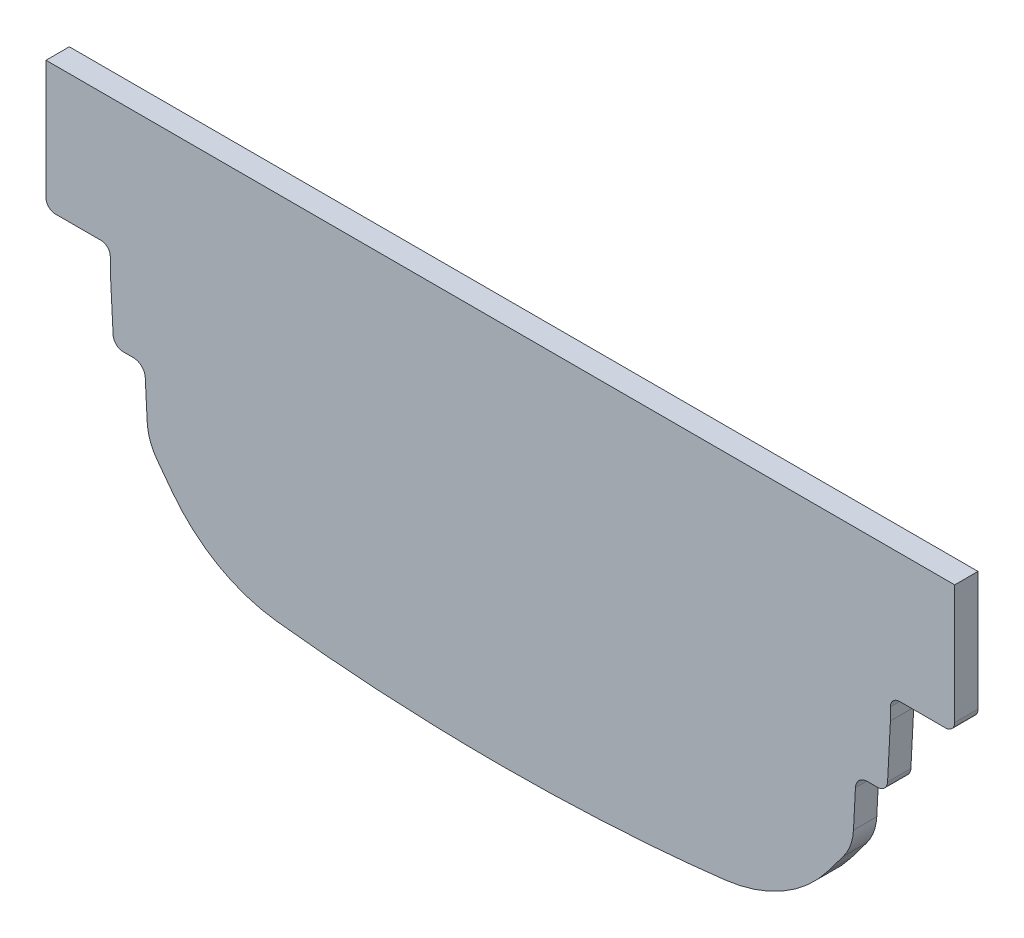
from build123d import *

# Parameters (mm, degrees)
BOSS_EXTRUDE1_DEPTH = 12.7


with BuildPart() as part:
    # Sketch1 → Boss-Extrude1 (new body)
    with BuildSketch(Plane.XY.offset(64.75)):
        with BuildLine():
            Line((212.453485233, -15.999999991), (-212.453485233, -15.999999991))
            Line((-212.453485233, -15.999999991), (-247.453485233, -15.999999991))
            Line((-247.453485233, -15.999999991), (-247.453485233, -80.999999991))
            ThreePointArc((-247.453485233, -80.999999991), (-245.989019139, -84.535533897), (-242.453485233, -85.999999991))
            Line((-242.453485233, -85.999999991), (-217.453485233, -85.999999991))
            ThreePointArc((-217.453485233, -85.999999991), (-213.917951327, -87.464466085), (-212.453485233, -90.999999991))
            Line((-212.453485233, -90.999999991), (-212.453485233, -97.659816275))
            Line((-212.453485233, -97.659816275), (-210.900745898, -127.28784775))
            ThreePointArc((-210.900745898, -127.28784775), (-209.194233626, -130.989559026), (-205.408283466, -132.499999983))
            Line((-205.408283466, -132.499999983), (-199.892169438, -132.499999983))
            ThreePointArc((-199.892169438, -132.499999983), (-195.417864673, -134.285066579), (-193.401077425, -138.659816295))
            Line((-193.401077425, -138.659816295), (-192.321408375, -159.261128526))
            ThreePointArc((-192.321408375, -159.261128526), (-190.715694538, -167.185987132), (-186.874544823, -174.301271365))
            ThreePointArc((-186.874544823, -174.301271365), (-182.717820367, -179.845145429), (-178.552225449, -185.382357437))
            ThreePointArc((-178.552225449, -185.382357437), (-153.693494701, -207.326362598), (-122.21338872, -217.742637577))
            add(Edge.make_bspline(
                [(-122.21338872, -217.742637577), (-101.94589173, -220.139537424), (-61.253680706, -223.588540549), (-20.416378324, -224.706022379), (0, -224.706000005)],
                knots=[0, 0, 0, 0, 0.25, 0.499955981, 0.499955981, 0.499955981, 0.499955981], degree=3))
            add(Edge.make_bspline(
                [(122.21338872, -217.742637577), (101.945891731, -220.139537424), (61.253680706, -223.588540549), (20.416378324, -224.706022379), (0, -224.706000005)],
                knots=[0, 0, 0, 0, 0.25, 0.499955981, 0.499955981, 0.499955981, 0.499955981], degree=3))
            ThreePointArc((122.21338872, -217.742637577), (153.693494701, -207.326362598), (178.552225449, -185.382357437))
            ThreePointArc((178.552225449, -185.382357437), (182.717820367, -179.845145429), (186.874544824, -174.301271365))
            ThreePointArc((186.874544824, -174.301271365), (190.715694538, -167.185987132), (192.321408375, -159.261128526))
            Line((192.321408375, -159.261128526), (193.401077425, -138.659816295))
            ThreePointArc((193.401077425, -138.659816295), (195.417864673, -134.285066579), (199.892169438, -132.499999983))
            Line((199.892169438, -132.499999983), (205.408283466, -132.499999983))
            ThreePointArc((205.408283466, -132.499999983), (209.194233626, -130.989559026), (210.900745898, -127.28784775))
            Line((210.900745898, -127.28784775), (212.453485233, -97.659816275))
            Line((212.453485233, -97.659816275), (212.453485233, -90.999999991))
            ThreePointArc((212.453485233, -90.999999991), (213.917951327, -87.464466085), (217.453485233, -85.999999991))
            Line((217.453485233, -85.999999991), (242.453485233, -85.999999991))
            ThreePointArc((242.453485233, -85.999999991), (245.989019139, -84.535533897), (247.453485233, -80.999999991))
            Line((247.453485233, -80.999999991), (247.453485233, -15.999999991))
            Line((247.453485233, -15.999999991), (212.453485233, -15.999999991))
        make_face()
    extrude(amount=-BOSS_EXTRUDE1_DEPTH)


solid = part.part
